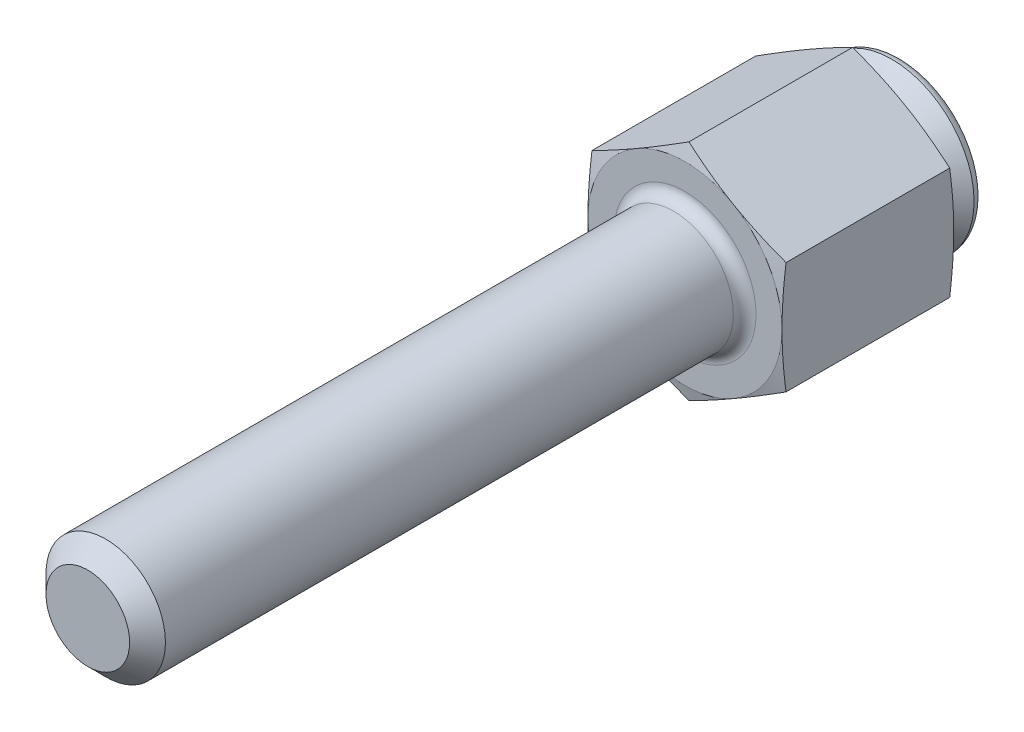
ISO-10303-21;
HEADER;
FILE_DESCRIPTION(('STEP AP214'),'2;1');
FILE_NAME('part.step','',(''),(''),'','','');
FILE_SCHEMA(('AUTOMOTIVE_DESIGN { 1 0 10303 214 1 1 1 1 }'));
ENDSEC;
DATA;
#1=APPLICATION_CONTEXT('core data for automotive mechanical design processes');
#2=APPLICATION_PROTOCOL_DEFINITION('international standard','automotive_design',2000,#1);
#3=PRODUCT_CONTEXT('',#1,'mechanical');
#4=PRODUCT('Part','Part','',(#3));
#5=PRODUCT_RELATED_PRODUCT_CATEGORY('part','',(#4));
#6=PRODUCT_DEFINITION_FORMATION('','',#4);
#7=PRODUCT_DEFINITION_CONTEXT('part definition',#1,'design');
#8=PRODUCT_DEFINITION('design','',#6,#7);
#9=PRODUCT_DEFINITION_SHAPE('','',#8);
#10=(LENGTH_UNIT() NAMED_UNIT(*) SI_UNIT(.MILLI.,.METRE.));
#11=(NAMED_UNIT(*) PLANE_ANGLE_UNIT() SI_UNIT($,.RADIAN.));
#12=(NAMED_UNIT(*) SI_UNIT($,.STERADIAN.) SOLID_ANGLE_UNIT());
#13=UNCERTAINTY_MEASURE_WITH_UNIT(LENGTH_MEASURE(1.E-05),#10,'distance_accuracy_value','');
#14=(GEOMETRIC_REPRESENTATION_CONTEXT(3) GLOBAL_UNCERTAINTY_ASSIGNED_CONTEXT((#13)) GLOBAL_UNIT_ASSIGNED_CONTEXT((#10,
#11,#12)) REPRESENTATION_CONTEXT('',''));
#15=CARTESIAN_POINT('',(0.,0.,0.));
#16=DIRECTION('',(0.,0.,1.));
#17=DIRECTION('',(1.,0.,0.));
#18=AXIS2_PLACEMENT_3D('',#15,#16,#17);
#19=CARTESIAN_POINT('',(0.,0.,6.5013999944));
#20=DIRECTION('',(0.,0.,-1.));
#21=DIRECTION('',(-0.250229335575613,0.968186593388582,0.));
#22=AXIS2_PLACEMENT_3D('',#19,#20,#21);
#23=SPHERICAL_SURFACE('',#22,5.);
#24=CARTESIAN_POINT('',(0.,0.,4.2191999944));
#25=DIRECTION('',(0.,0.,-1.));
#26=DIRECTION('',(-0.968186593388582,-0.250229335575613,0.));
#27=AXIS2_PLACEMENT_3D('',#24,#25,#26);
#28=CIRCLE('',#27,4.44877097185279);
#29=CARTESIAN_POINT('',(-1.1132130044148,4.30724041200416,4.2191999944));
#30=VERTEX_POINT('',#29);
#31=EDGE_CURVE('E9',#30,#30,#28,.F.);
#32=CARTESIAN_POINT('',(0.,0.,3.56696480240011));
#33=DIRECTION('',(0.,0.,1.));
#34=DIRECTION('',(-0.250229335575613,0.968186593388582,0.));
#35=AXIS2_PLACEMENT_3D('',#32,#33,#34);
#36=CIRCLE('',#35,4.04834411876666);
#37=CARTESIAN_POINT('',(-1.01301445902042,3.91955250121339,3.56696480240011));
#38=VERTEX_POINT('',#37);
#39=EDGE_CURVE('E282',#38,#38,#36,.T.);
#40=CARTESIAN_POINT('',(-1.1132130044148,4.30724041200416,4.2191999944));
#41=CARTESIAN_POINT('',(-1.11230155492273,4.30371383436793,4.21209962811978));
#42=CARTESIAN_POINT('',(-1.11138585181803,4.30017079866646,4.20500798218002));
#43=CARTESIAN_POINT('',(-1.10954595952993,4.29305189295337,4.19084229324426));
#44=CARTESIAN_POINT('',(-1.10862177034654,4.28947602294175,4.18376825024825));
#45=CARTESIAN_POINT('',(-1.10676492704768,4.2822915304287,4.16963792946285));
#46=CARTESIAN_POINT('',(-1.1058322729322,4.27868290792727,4.16258165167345));
#47=CARTESIAN_POINT('',(-1.10395852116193,4.27143299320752,4.14848702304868));
#48=CARTESIAN_POINT('',(-1.10301742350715,4.26779170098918,4.14144867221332));
#49=CARTESIAN_POINT('',(-1.10112680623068,4.26047653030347,4.12739005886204));
#50=CARTESIAN_POINT('',(-1.10017728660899,4.25680265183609,4.12036979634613));
#51=CARTESIAN_POINT('',(-1.09826984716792,4.24942239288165,4.10634752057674));
#52=CARTESIAN_POINT('',(-1.09731192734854,4.24571601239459,4.09934550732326));
#53=CARTESIAN_POINT('',(-1.09538770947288,4.23827083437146,4.08535989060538));
#54=CARTESIAN_POINT('',(-1.0944214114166,4.23453203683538,4.07837628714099));
#55=CARTESIAN_POINT('',(-1.09248045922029,4.22702211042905,4.06442765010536));
#56=CARTESIAN_POINT('',(-1.09150580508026,4.22325098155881,4.05746261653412));
#57=CARTESIAN_POINT('',(-1.08954816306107,4.21567647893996,4.04355127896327));
#58=CARTESIAN_POINT('',(-1.08856517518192,4.21187310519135,4.03660497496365));
#59=CARTESIAN_POINT('',(-1.08659088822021,4.2042342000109,4.0227312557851));
#60=CARTESIAN_POINT('',(-1.08559958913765,4.20039866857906,4.01580384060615));
#61=CARTESIAN_POINT('',(-1.08360870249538,4.19269553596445,4.00196805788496));
#62=CARTESIAN_POINT('',(-1.08260911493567,4.1888279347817,3.99505969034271));
#63=CARTESIAN_POINT('',(-1.08060167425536,4.18106075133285,3.98126216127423));
#64=CARTESIAN_POINT('',(-1.07959382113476,4.17716116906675,3.97437299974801));
#65=CARTESIAN_POINT('',(-1.07756987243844,4.16933011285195,3.96061404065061));
#66=CARTESIAN_POINT('',(-1.07655377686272,4.16539863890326,3.95374424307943));
#67=CARTESIAN_POINT('',(-1.07451336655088,4.15750388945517,3.94002416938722));
#68=CARTESIAN_POINT('',(-1.07348905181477,4.15354061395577,3.93317389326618));
#69=CARTESIAN_POINT('',(-1.0714322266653,4.14558235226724,3.91949301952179));
#70=CARTESIAN_POINT('',(-1.07039971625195,4.14158736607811,3.91266242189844));
#71=CARTESIAN_POINT('',(-1.06832652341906,4.13356577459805,3.89902106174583));
#72=CARTESIAN_POINT('',(-1.06728584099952,4.12953916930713,3.89221029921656));
#73=CARTESIAN_POINT('',(-1.06519632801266,4.12145443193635,3.8786087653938));
#74=CARTESIAN_POINT('',(-1.06414749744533,4.11739629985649,3.8718179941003));
#75=CARTESIAN_POINT('',(-1.06204171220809,4.10924860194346,3.8582565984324));
#76=CARTESIAN_POINT('',(-1.06098475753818,4.10515903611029,3.85148597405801));
#77=CARTESIAN_POINT('',(-1.05886274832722,4.09694856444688,3.83796502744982));
#78=CARTESIAN_POINT('',(-1.05779769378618,4.09282765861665,3.83121470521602));
#79=CARTESIAN_POINT('',(-1.0556595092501,4.08455460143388,3.81773451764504));
#80=CARTESIAN_POINT('',(-1.05458637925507,4.08040245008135,3.81100465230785));
#81=CARTESIAN_POINT('',(-1.0524320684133,4.07206699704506,3.79756553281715));
#82=CARTESIAN_POINT('',(-1.05135088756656,4.06788369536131,3.79085627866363));
#83=CARTESIAN_POINT('',(-1.04918049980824,4.0594860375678,3.77745853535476));
#84=CARTESIAN_POINT('',(-1.04809129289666,4.05527168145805,3.77077004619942));
#85=CARTESIAN_POINT('',(-1.0459048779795,4.04681201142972,3.75741398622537));
#86=CARTESIAN_POINT('',(-1.04480766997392,4.04256669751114,3.75074641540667));
#87=CARTESIAN_POINT('',(-1.04260527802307,4.03404520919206,3.7374323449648));
#88=CARTESIAN_POINT('',(-1.0415000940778,4.02976903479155,3.73078584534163));
#89=CARTESIAN_POINT('',(-1.03928177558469,4.021185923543,3.71751406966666));
#90=CARTESIAN_POINT('',(-1.03816864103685,4.01687898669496,3.71088879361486));
#91=CARTESIAN_POINT('',(-1.03593444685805,4.00823444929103,3.69765961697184));
#92=CARTESIAN_POINT('',(-1.03481338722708,4.00389684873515,3.69105571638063));
#93=CARTESIAN_POINT('',(-1.03256336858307,3.99519108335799,3.67786944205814));
#94=CARTESIAN_POINT('',(-1.03143440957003,3.99082291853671,3.67128706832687));
#95=CARTESIAN_POINT('',(-1.02916861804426,3.98205612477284,3.65814399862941));
#96=CARTESIAN_POINT('',(-1.02803178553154,3.97765749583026,3.65158330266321));
#97=CARTESIAN_POINT('',(-1.0257502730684,3.96882987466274,3.63848373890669));
#98=CARTESIAN_POINT('',(-1.02460559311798,3.96440088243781,3.63194487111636));
#99=CARTESIAN_POINT('',(-1.02230841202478,3.95551263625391,3.61888911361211));
#100=CARTESIAN_POINT('',(-1.02115591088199,3.95105338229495,3.61237222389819));
#101=CARTESIAN_POINT('',(-1.01884311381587,3.94210471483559,3.59936057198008));
#102=CARTESIAN_POINT('',(-1.01768281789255,3.93761530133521,3.5928658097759));
#103=CARTESIAN_POINT('',(-1.01535445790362,3.92860641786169,3.57989856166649));
#104=CARTESIAN_POINT('',(-1.01418639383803,3.92408694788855,3.57342607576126));
#105=CARTESIAN_POINT('',(-1.01301445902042,3.91955250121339,3.56696480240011));
#106=B_SPLINE_CURVE_WITH_KNOTS('',3,(#40,#41,#42,#43,#44,#45,#46,#47,#48,#49,#50,#51,#52,#53,
#54,#55,#56,#57,#58,#59,#60,#61,#62,#63,#64,#65,#66,#67,#68,#69,#70,#71,#72,#73,#74,#75,#76,#77,
#78,#79,#80,#81,#82,#83,#84,#85,#86,#87,#88,#89,#90,#91,#92,#93,#94,#95,#96,#97,#98,#99,#100,
#101,#102,#103,#104,#105),.UNSPECIFIED.,.F.,.F.,(4,2,2,2,2,2,2,2,2,2,2,2,2,2,2,2,2,2,2,2,2,2,2,
2,2,2,2,2,2,2,2,2,4),(0.,0.0239404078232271,0.0478808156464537,0.0718212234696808,
0.0957616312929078,0.119702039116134,0.143642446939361,0.167582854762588,0.191523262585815,
0.215463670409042,0.239404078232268,0.263344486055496,0.287284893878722,0.311225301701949,
0.335165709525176,0.359106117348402,0.383046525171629,0.406986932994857,0.430927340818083,
0.45486774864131,0.478808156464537,0.502748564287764,0.52668897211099,0.550629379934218,
0.574569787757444,0.598510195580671,0.622450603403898,0.646391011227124,0.670331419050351,
0.694271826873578,0.718212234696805,0.742152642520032,0.766093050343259),.UNSPECIFIED.);
#107=EDGE_CURVE('BSEAM14',#30,#38,#106,.T.);
#108=ORIENTED_EDGE('',*,*,#31,.F.);
#109=ORIENTED_EDGE('',*,*,#39,.T.);
#110=ORIENTED_EDGE('',*,*,#107,.T.);
#111=ORIENTED_EDGE('',*,*,#107,.F.);
#112=EDGE_LOOP('',(#108,#110,#109,#111));
#113=FACE_BOUND('',#112,.T.);
#114=ADVANCED_FACE('F14',(#113),#23,.T.);
#115=CARTESIAN_POINT('',(0.,0.,0.));
#116=DIRECTION('',(0.,0.,-1.));
#117=DIRECTION('',(0.250229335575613,-0.968186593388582,0.));
#118=AXIS2_PLACEMENT_3D('',#115,#116,#117);
#119=CYLINDRICAL_SURFACE('',#118,4.);
#120=CARTESIAN_POINT('',(0.,0.,3.41789549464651));
#121=DIRECTION('',(0.,0.,1.));
#122=DIRECTION('',(-0.250229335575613,0.968186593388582,0.));
#123=AXIS2_PLACEMENT_3D('',#120,#121,#122);
#124=CIRCLE('',#123,4.);
#125=CARTESIAN_POINT('',(-1.00091734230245,3.87274637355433,3.41789549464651));
#126=VERTEX_POINT('',#125);
#127=EDGE_CURVE('E280',#126,#126,#124,.F.);
#128=ORIENTED_EDGE('',*,*,#127,.T.);
#129=EDGE_LOOP('',(#128));
#130=FACE_BOUND('',#129,.T.);
#131=CARTESIAN_POINT('',(0.,0.,2.24021024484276));
#132=DIRECTION('',(0.,0.,-1.));
#133=DIRECTION('',(0.250229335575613,-0.968186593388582,0.));
#134=AXIS2_PLACEMENT_3D('',#131,#132,#133);
#135=CIRCLE('',#134,4.);
#136=CARTESIAN_POINT('',(1.00091734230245,-3.87274637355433,2.24021024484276));
#137=VERTEX_POINT('',#136);
#138=EDGE_CURVE('E277',#137,#137,#135,.F.);
#139=ORIENTED_EDGE('',*,*,#138,.T.);
#140=EDGE_LOOP('',(#139));
#141=FACE_BOUND('',#140,.T.);
#142=ADVANCED_FACE('F388',(#130,#141),#119,.T.);
#143=CARTESIAN_POINT('',(0.,0.,2.135));
#144=DIRECTION('',(0.,0.,-1.));
#145=DIRECTION('',(0.250229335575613,-0.968186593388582,0.));
#146=AXIS2_PLACEMENT_3D('',#143,#144,#145);
#147=CONICAL_SURFACE('',#146,4.,0.78539816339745);
#148=CARTESIAN_POINT('',(0.,0.,2.06060512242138));
#149=DIRECTION('',(0.,0.,-1.));
#150=DIRECTION('',(0.250229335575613,-0.968186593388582,0.));
#151=AXIS2_PLACEMENT_3D('',#148,#149,#150);
#152=CIRCLE('',#151,4.07439487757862);
#153=CARTESIAN_POINT('',(1.01953312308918,-3.94477449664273,2.06060512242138));
#154=VERTEX_POINT('',#153);
#155=EDGE_CURVE('E18',#154,#154,#152,.T.);
#156=ORIENTED_EDGE('',*,*,#155,.T.);
#157=EDGE_LOOP('',(#156));
#158=FACE_BOUND('',#157,.T.);
#159=CARTESIAN_POINT('',(0.,0.,0.635));
#160=DIRECTION('',(0.,0.,-1.));
#161=DIRECTION('',(0.250229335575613,-0.968186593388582,0.));
#162=AXIS2_PLACEMENT_3D('',#159,#160,#161);
#163=CIRCLE('',#162,5.5);
#164=CARTESIAN_POINT('',(1.37626134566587,-5.3250262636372,0.635));
#165=VERTEX_POINT('',#164);
#166=EDGE_CURVE('E271',#165,#165,#163,.T.);
#167=ORIENTED_EDGE('',*,*,#166,.F.);
#168=EDGE_LOOP('',(#167));
#169=FACE_BOUND('',#168,.T.);
#170=ADVANCED_FACE('F384',(#158,#169),#147,.T.);
#171=CARTESIAN_POINT('',(-1.37626134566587,5.3250262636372,0.));
#172=DIRECTION('',(0.,0.,1.));
#173=DIRECTION('',(-0.250229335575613,0.968186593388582,0.));
#174=AXIS2_PLACEMENT_3D('',#171,#172,#173);
#175=PLANE('',#174);
#176=CARTESIAN_POINT('',(0.,0.,0.));
#177=DIRECTION('',(0.,0.,1.));
#178=DIRECTION('',(-0.250229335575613,0.968186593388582,0.));
#179=AXIS2_PLACEMENT_3D('',#176,#177,#178);
#180=CIRCLE('',#179,4.865);
#181=CARTESIAN_POINT('',(-1.21736571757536,4.71022777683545,0.));
#182=VERTEX_POINT('',#181);
#183=EDGE_CURVE('E274',#182,#182,#180,.F.);
#184=ORIENTED_EDGE('',*,*,#183,.T.);
#185=EDGE_LOOP('',(#184));
#186=FACE_BOUND('',#185,.T.);
#187=ADVANCED_FACE('F380',(#186),#175,.F.);
#188=CARTESIAN_POINT('',(0.,0.,0.635));
#189=DIRECTION('',(0.,0.,1.));
#190=DIRECTION('',(-0.250229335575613,0.968186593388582,0.));
#191=AXIS2_PLACEMENT_3D('',#188,#189,#190);
#192=TOROIDAL_SURFACE('',#191,4.865,0.635);
#193=ORIENTED_EDGE('',*,*,#166,.T.);
#194=EDGE_LOOP('',(#193));
#195=FACE_BOUND('',#194,.T.);
#196=ORIENTED_EDGE('',*,*,#183,.F.);
#197=EDGE_LOOP('',(#196));
#198=FACE_BOUND('',#197,.T.);
#199=ADVANCED_FACE('F383',(#195,#198),#192,.T.);
#200=CARTESIAN_POINT('',(0.,0.,3.41789549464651));
#201=DIRECTION('',(0.,0.,1.));
#202=DIRECTION('',(-0.250229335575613,0.968186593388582,0.));
#203=AXIS2_PLACEMENT_3D('',#200,#201,#202);
#204=TOROIDAL_SURFACE('',#203,4.254,0.254);
#205=ORIENTED_EDGE('',*,*,#39,.F.);
#206=EDGE_LOOP('',(#205));
#207=FACE_BOUND('',#206,.T.);
#208=ORIENTED_EDGE('',*,*,#127,.F.);
#209=EDGE_LOOP('',(#208));
#210=FACE_BOUND('',#209,.T.);
#211=ADVANCED_FACE('F397',(#207,#210),#204,.F.);
#212=CARTESIAN_POINT('',(0.,0.,2.24021024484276));
#213=DIRECTION('',(0.,0.,-1.));
#214=DIRECTION('',(0.250229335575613,-0.968186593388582,0.));
#215=AXIS2_PLACEMENT_3D('',#212,#213,#214);
#216=TOROIDAL_SURFACE('',#215,4.254,0.254);
#217=ORIENTED_EDGE('',*,*,#138,.F.);
#218=EDGE_LOOP('',(#217));
#219=FACE_BOUND('',#218,.T.);
#220=ORIENTED_EDGE('',*,*,#155,.F.);
#221=EDGE_LOOP('',(#220));
#222=FACE_BOUND('',#221,.T.);
#223=ADVANCED_FACE('F16',(#219,#222),#216,.F.);
#224=CARTESIAN_POINT('',(0.,0.,54.4999999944));
#225=DIRECTION('',(0.,0.,1.));
#226=DIRECTION('',(1.,0.,0.));
#227=AXIS2_PLACEMENT_3D('',#224,#225,#226);
#228=PLANE('',#227);
#229=CARTESIAN_POINT('',(0.,0.,54.4999999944));
#230=DIRECTION('',(0.,0.,1.));
#231=DIRECTION('',(1.,0.,0.));
#232=AXIS2_PLACEMENT_3D('',#229,#230,#231);
#233=CIRCLE('',#232,2.8);
#234=CARTESIAN_POINT('',(2.8,0.,54.4999999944));
#235=VERTEX_POINT('',#234);
#236=EDGE_CURVE('E266',#235,#235,#233,.T.);
#237=ORIENTED_EDGE('',*,*,#236,.T.);
#238=EDGE_LOOP('',(#237));
#239=FACE_BOUND('',#238,.T.);
#240=ADVANCED_FACE('F378',(#239),#228,.T.);
#241=CARTESIAN_POINT('',(0.,0.,54.4999999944));
#242=DIRECTION('',(0.,0.,-1.));
#243=DIRECTION('',(-1.,0.,0.));
#244=AXIS2_PLACEMENT_3D('',#241,#242,#243);
#245=CONICAL_SURFACE('',#244,2.8,0.785398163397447);
#246=CARTESIAN_POINT('',(0.,0.,53.2999999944));
#247=DIRECTION('',(0.,0.,1.));
#248=DIRECTION('',(1.,0.,0.));
#249=AXIS2_PLACEMENT_3D('',#246,#247,#248);
#250=CIRCLE('',#249,4.);
#251=CARTESIAN_POINT('',(4.,0.,53.2999999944));
#252=VERTEX_POINT('',#251);
#253=EDGE_CURVE('E23',#252,#252,#250,.F.);
#254=ORIENTED_EDGE('',*,*,#253,.F.);
#255=EDGE_LOOP('',(#254));
#256=FACE_BOUND('',#255,.T.);
#257=ORIENTED_EDGE('',*,*,#236,.F.);
#258=EDGE_LOOP('',(#257));
#259=FACE_BOUND('',#258,.T.);
#260=ADVANCED_FACE('F375',(#256,#259),#245,.T.);
#261=CARTESIAN_POINT('',(0.,0.,54.4999999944));
#262=DIRECTION('',(0.,0.,-1.));
#263=DIRECTION('',(-1.,0.,0.));
#264=AXIS2_PLACEMENT_3D('',#261,#262,#263);
#265=CYLINDRICAL_SURFACE('',#264,4.);
#266=ORIENTED_EDGE('',*,*,#253,.T.);
#267=EDGE_LOOP('',(#266));
#268=FACE_BOUND('',#267,.T.);
#269=CARTESIAN_POINT('',(0.,0.,15.2619999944));
#270=DIRECTION('',(0.,0.,1.));
#271=DIRECTION('',(1.,0.,0.));
#272=AXIS2_PLACEMENT_3D('',#269,#270,#271);
#273=CIRCLE('',#272,4.);
#274=CARTESIAN_POINT('',(4.,0.,15.2619999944));
#275=VERTEX_POINT('',#274);
#276=EDGE_CURVE('E260',#275,#275,#273,.T.);
#277=ORIENTED_EDGE('',*,*,#276,.T.);
#278=EDGE_LOOP('',(#277));
#279=FACE_BOUND('',#278,.T.);
#280=ADVANCED_FACE('F373',(#268,#279),#265,.T.);
#281=CARTESIAN_POINT('',(0.,0.,15.2619999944));
#282=DIRECTION('',(0.,0.,1.));
#283=DIRECTION('',(1.,0.,0.));
#284=AXIS2_PLACEMENT_3D('',#281,#282,#283);
#285=TOROIDAL_SURFACE('',#284,4.762,0.762);
#286=CARTESIAN_POINT('',(0.,0.,14.4999999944));
#287=DIRECTION('',(0.,0.,1.));
#288=DIRECTION('',(1.,0.,0.));
#289=AXIS2_PLACEMENT_3D('',#286,#287,#288);
#290=CIRCLE('',#289,4.762);
#291=CARTESIAN_POINT('',(4.762,0.,14.4999999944));
#292=VERTEX_POINT('',#291);
#293=EDGE_CURVE('E263',#292,#292,#290,.F.);
#294=ORIENTED_EDGE('',*,*,#293,.F.);
#295=EDGE_LOOP('',(#294));
#296=FACE_BOUND('',#295,.T.);
#297=ORIENTED_EDGE('',*,*,#276,.F.);
#298=EDGE_LOOP('',(#297));
#299=FACE_BOUND('',#298,.T.);
#300=ADVANCED_FACE('F370',(#296,#299),#285,.F.);
#301=CARTESIAN_POINT('',(-6.5,-3.75277674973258,14.4999999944));
#302=DIRECTION('',(0.,0.,1.));
#303=DIRECTION('',(1.,0.,0.));
#304=AXIS2_PLACEMENT_3D('',#301,#302,#303);
#305=PLANE('',#304);
#306=CARTESIAN_POINT('',(0.,0.,14.4999999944));
#307=DIRECTION('',(0.,0.,1.));
#308=DIRECTION('',(1.,0.,0.));
#309=AXIS2_PLACEMENT_3D('',#306,#307,#308);
#310=CIRCLE('',#309,6.5);
#311=CARTESIAN_POINT('',(3.25,-5.62916512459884,14.4999999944));
#312=VERTEX_POINT('',#311);
#313=CARTESIAN_POINT('',(6.5,0.,14.4999999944));
#314=VERTEX_POINT('',#313);
#315=EDGE_CURVE('E239',#312,#314,#310,.T.);
#316=ORIENTED_EDGE('',*,*,#315,.T.);
#317=CARTESIAN_POINT('',(3.25,5.62916512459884,14.4999999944));
#318=VERTEX_POINT('',#317);
#319=EDGE_CURVE('E130',#314,#318,#310,.T.);
#320=ORIENTED_EDGE('',*,*,#319,.T.);
#321=CARTESIAN_POINT('',(-3.25,5.62916512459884,14.4999999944));
#322=VERTEX_POINT('',#321);
#323=EDGE_CURVE('E331',#318,#322,#310,.T.);
#324=ORIENTED_EDGE('',*,*,#323,.T.);
#325=CARTESIAN_POINT('',(0.,0.,14.4999999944));
#326=DIRECTION('',(0.,0.,-1.));
#327=DIRECTION('',(-1.,0.,0.));
#328=AXIS2_PLACEMENT_3D('',#325,#326,#327);
#329=CIRCLE('',#328,6.5);
#330=CARTESIAN_POINT('',(-6.5,0.,14.4999999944));
#331=VERTEX_POINT('',#330);
#332=EDGE_CURVE('E668',#331,#322,#329,.T.);
#333=ORIENTED_EDGE('',*,*,#332,.F.);
#334=CARTESIAN_POINT('',(-3.25,-5.62916512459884,14.4999999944));
#335=VERTEX_POINT('',#334);
#336=EDGE_CURVE('E330',#331,#335,#310,.T.);
#337=ORIENTED_EDGE('',*,*,#336,.T.);
#338=EDGE_CURVE('E253',#335,#312,#310,.T.);
#339=ORIENTED_EDGE('',*,*,#338,.T.);
#340=EDGE_LOOP('',(#316,#320,#324,#333,#337,#339));
#341=FACE_BOUND('',#340,.T.);
#342=ORIENTED_EDGE('',*,*,#293,.T.);
#343=EDGE_LOOP('',(#342));
#344=FACE_BOUND('',#343,.T.);
#345=ADVANCED_FACE('F326',(#341,#344),#305,.T.);
#346=CARTESIAN_POINT('',(0.,0.,13.0858363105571));
#347=DIRECTION('',(0.,0.,-1.));
#348=DIRECTION('',(-1.,0.,0.));
#349=AXIS2_PLACEMENT_3D('',#346,#347,#348);
#350=CONICAL_SURFACE('',#349,11.7777307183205,1.30899693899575);
#351=ORIENTED_EDGE('',*,*,#332,.T.);
#352=CARTESIAN_POINT('',(-6.5002,3.75266127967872,14.2305318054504));
#353=CARTESIAN_POINT('',(-6.23025475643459,3.90851423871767,14.272310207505));
#354=CARTESIAN_POINT('',(-5.95982006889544,4.06464977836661,14.3102381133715));
#355=CARTESIAN_POINT('',(-5.41799562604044,4.37747226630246,14.3768739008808));
#356=CARTESIAN_POINT('',(-5.14660552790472,4.53415941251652,14.4055780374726));
#357=CARTESIAN_POINT('',(-4.60451571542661,4.84713511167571,14.4520905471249));
#358=CARTESIAN_POINT('',(-4.33381966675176,5.00342154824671,14.4699543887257));
#359=CARTESIAN_POINT('',(-3.79208236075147,5.31619372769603,14.4939079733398));
#360=CARTESIAN_POINT('',(-3.52104118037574,5.47267942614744,14.4999999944));
#361=CARTESIAN_POINT('',(-2.97895881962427,5.78565082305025,14.4999999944));
#362=CARTESIAN_POINT('',(-2.70791763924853,5.94213652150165,14.4939079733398));
#363=CARTESIAN_POINT('',(-2.16618033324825,6.25490870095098,14.4699543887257));
#364=CARTESIAN_POINT('',(-1.8954842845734,6.41119513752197,14.4520905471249));
#365=CARTESIAN_POINT('',(-1.35339447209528,6.72417083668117,14.4055780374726));
#366=CARTESIAN_POINT('',(-1.08200437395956,6.88085798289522,14.3768739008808));
#367=CARTESIAN_POINT('',(-0.540179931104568,7.19368047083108,14.3102381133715));
#368=CARTESIAN_POINT('',(-0.269745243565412,7.34981601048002,14.272310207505));
#369=CARTESIAN_POINT('',(0.000199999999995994,7.50566896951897,14.2305318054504));
#370=B_SPLINE_CURVE_WITH_KNOTS('',3,(#352,#353,#354,#355,#356,#357,#358,#359,#360,#361,#362,
#363,#364,#365,#366,#367,#368,#369),.UNSPECIFIED.,.F.,.F.,(4,2,2,2,2,2,2,2,4),(0.,
0.943529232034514,1.88744107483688,2.82648138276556,3.76533995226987,4.70419852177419,
5.64323882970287,6.58715067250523,7.53067990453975),.UNSPECIFIED.);
#371=CARTESIAN_POINT('',(-6.5,3.75277674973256,14.230562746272));
#372=VERTEX_POINT('',#371);
#373=EDGE_CURVE('E338',#372,#322,#370,.T.);
#374=ORIENTED_EDGE('',*,*,#373,.F.);
#375=CARTESIAN_POINT('',(-6.5,-10.0044654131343,13.0448738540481));
#376=CARTESIAN_POINT('',(-6.5,-9.7086784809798,13.1113166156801));
#377=CARTESIAN_POINT('',(-6.5,-9.41270865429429,13.1769595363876));
#378=CARTESIAN_POINT('',(-6.5,-8.82031321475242,13.3062138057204));
#379=CARTESIAN_POINT('',(-6.5,-8.52388758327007,13.36982506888));
#380=CARTESIAN_POINT('',(-6.5,-7.93023646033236,13.494637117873));
#381=CARTESIAN_POINT('',(-6.5,-7.63301047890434,13.5558355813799));
#382=CARTESIAN_POINT('',(-6.5,-7.03794541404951,13.6751737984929));
#383=CARTESIAN_POINT('',(-6.5,-6.74010633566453,13.7333135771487));
#384=CARTESIAN_POINT('',(-6.5,-6.14610081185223,13.8453527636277));
#385=CARTESIAN_POINT('',(-6.5,-5.84994010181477,13.8992824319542));
#386=CARTESIAN_POINT('',(-6.5,-5.25681519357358,14.0025175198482));
#387=CARTESIAN_POINT('',(-6.5,-4.95985101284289,14.0518230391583));
#388=CARTESIAN_POINT('',(-6.5,-4.36505179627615,14.1447161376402));
#389=CARTESIAN_POINT('',(-6.5,-4.06721684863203,14.1883042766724));
#390=CARTESIAN_POINT('',(-6.5,-3.47059684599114,14.2684922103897));
#391=CARTESIAN_POINT('',(-6.5,-3.17181178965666,14.305091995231));
#392=CARTESIAN_POINT('',(-6.5,-2.56988519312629,14.3702843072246));
#393=CARTESIAN_POINT('',(-6.5,-2.26673301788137,14.3987800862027));
#394=CARTESIAN_POINT('',(-6.5,-1.65965008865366,14.4458085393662));
#395=CARTESIAN_POINT('',(-6.5,-1.35571935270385,14.4643414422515));
#396=CARTESIAN_POINT('',(-6.5,-0.747523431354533,14.4903642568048));
#397=CARTESIAN_POINT('',(-6.5,-0.443258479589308,14.4978595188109));
#398=CARTESIAN_POINT('',(-6.5,0.165338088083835,14.501344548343));
#399=CARTESIAN_POINT('',(-6.5,0.469669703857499,14.4973343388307));
#400=CARTESIAN_POINT('',(-6.5,1.07910960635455,14.4780322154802));
#401=CARTESIAN_POINT('',(-6.5,1.38421652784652,14.4626980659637));
#402=CARTESIAN_POINT('',(-6.5,1.99372315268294,14.4216291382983));
#403=CARTESIAN_POINT('',(-6.5,2.29812283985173,14.3958941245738));
#404=CARTESIAN_POINT('',(-6.50000000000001,2.90621194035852,14.3353423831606));
#405=CARTESIAN_POINT('',(-6.50000000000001,3.20990073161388,14.3005195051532));
#406=CARTESIAN_POINT('',(-6.5,3.8162976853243,14.2232646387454));
#407=CARTESIAN_POINT('',(-6.5,4.11900584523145,14.180832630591));
#408=CARTESIAN_POINT('',(-6.5,4.7153060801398,14.0909709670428));
#409=CARTESIAN_POINT('',(-6.5,5.0089234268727,14.0437073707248));
#410=CARTESIAN_POINT('',(-6.50000000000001,5.59535016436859,13.9443851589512));
#411=CARTESIAN_POINT('',(-6.50000000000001,5.88815952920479,13.8923263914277));
#412=CARTESIAN_POINT('',(-6.50000000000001,6.47308937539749,13.7843266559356));
#413=CARTESIAN_POINT('',(-6.50000000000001,6.76520978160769,13.7283852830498));
#414=CARTESIAN_POINT('',(-6.50000000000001,7.34883235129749,13.6133576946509));
#415=CARTESIAN_POINT('',(-6.50000000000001,7.64033450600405,13.5542714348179));
#416=CARTESIAN_POINT('',(-6.50000000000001,8.51421406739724,13.3731782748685));
#417=CARTESIAN_POINT('',(-6.50000000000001,9.09580222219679,13.2473677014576));
#418=CARTESIAN_POINT('',(-6.50000000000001,10.2574156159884,12.9889787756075));
#419=CARTESIAN_POINT('',(-6.50000000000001,10.8374409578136,12.856400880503));
#420=CARTESIAN_POINT('',(-6.50000000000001,11.9903925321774,12.587928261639));
#421=CARTESIAN_POINT('',(-6.50000000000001,12.5633300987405,12.4520820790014));
#422=CARTESIAN_POINT('',(-6.50000000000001,13.7084200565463,12.1770780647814));
#423=CARTESIAN_POINT('',(-6.50000000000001,14.2805724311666,12.0379201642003));
#424=CARTESIAN_POINT('',(-6.50000000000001,15.4235044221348,11.757366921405));
#425=CARTESIAN_POINT('',(-6.50000000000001,15.9942848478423,11.6159748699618));
#426=CARTESIAN_POINT('',(-6.50000000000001,17.1353614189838,11.3313338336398));
#427=CARTESIAN_POINT('',(-6.50000000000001,17.7056575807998,11.1880849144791));
#428=CARTESIAN_POINT('',(-6.5,18.2757873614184,11.0441847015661));
#429=B_SPLINE_CURVE_WITH_KNOTS('',3,(#375,#376,#377,#378,#379,#380,#381,#382,#383,#384,#385,
#386,#387,#388,#389,#390,#391,#392,#393,#394,#395,#396,#397,#398,#399,#400,#401,#402,#403,#404,
#405,#406,#407,#408,#409,#410,#411,#412,#413,#414,#415,#416,#417,#418,#419,#420,#421,#422,#423,
#424,#425,#426,#427,#428),.UNSPECIFIED.,.F.,.F.,(4,2,2,2,2,2,2,2,2,2,2,2,2,2,2,2,2,2,2,2,2,2,2,
2,2,2,4),(0.,0.909476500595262,1.8189912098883,2.72936096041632,3.63972325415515,
4.54278656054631,5.44583038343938,6.34878571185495,7.2517423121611,8.16506499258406,
9.07836670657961,9.9912255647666,10.9040826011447,11.8203616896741,12.736661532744,
13.6535831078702,14.5705070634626,15.4626502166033,16.3548216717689,17.24708631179,
18.1393635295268,19.9244135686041,21.7093431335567,23.4757957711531,25.2422852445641,
27.0063787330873,28.7704099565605),.UNSPECIFIED.);
#430=EDGE_CURVE('E337',#331,#372,#429,.T.);
#431=ORIENTED_EDGE('',*,*,#430,.F.);
#432=EDGE_LOOP('',(#351,#374,#431));
#433=FACE_BOUND('',#432,.T.);
#434=ADVANCED_FACE('F439',(#433),#350,.T.);
#435=ORIENTED_EDGE('',*,*,#336,.F.);
#436=CARTESIAN_POINT('',(-6.5,-3.75277674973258,14.230562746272));
#437=VERTEX_POINT('',#436);
#438=EDGE_CURVE('E308',#437,#331,#429,.T.);
#439=ORIENTED_EDGE('',*,*,#438,.F.);
#440=CARTESIAN_POINT('',(0.000199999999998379,-7.50566896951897,14.2305318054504));
#441=CARTESIAN_POINT('',(-0.26974524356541,-7.34981601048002,14.272310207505));
#442=CARTESIAN_POINT('',(-0.540179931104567,-7.19368047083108,14.3102381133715));
#443=CARTESIAN_POINT('',(-1.08200437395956,-6.88085798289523,14.3768739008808));
#444=CARTESIAN_POINT('',(-1.35339447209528,-6.72417083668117,14.4055780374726));
#445=CARTESIAN_POINT('',(-1.89548428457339,-6.41119513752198,14.4520905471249));
#446=CARTESIAN_POINT('',(-2.16618033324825,-6.25490870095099,14.4699543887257));
#447=CARTESIAN_POINT('',(-2.70791763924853,-5.94213652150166,14.4939079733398));
#448=CARTESIAN_POINT('',(-2.97895881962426,-5.78565082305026,14.4999999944));
#449=CARTESIAN_POINT('',(-3.52104118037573,-5.47267942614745,14.4999999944));
#450=CARTESIAN_POINT('',(-3.79208236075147,-5.31619372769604,14.4939079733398));
#451=CARTESIAN_POINT('',(-4.33381966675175,-5.00342154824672,14.4699543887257));
#452=CARTESIAN_POINT('',(-4.60451571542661,-4.84713511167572,14.4520905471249));
#453=CARTESIAN_POINT('',(-5.14660552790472,-4.53415941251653,14.4055780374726));
#454=CARTESIAN_POINT('',(-5.41799562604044,-4.37747226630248,14.3768739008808));
#455=CARTESIAN_POINT('',(-5.95982006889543,-4.06464977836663,14.3102381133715));
#456=CARTESIAN_POINT('',(-6.23025475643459,-3.90851423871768,14.272310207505));
#457=CARTESIAN_POINT('',(-6.5002,-3.75266127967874,14.2305318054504));
#458=B_SPLINE_CURVE_WITH_KNOTS('',3,(#440,#441,#442,#443,#444,#445,#446,#447,#448,#449,#450,
#451,#452,#453,#454,#455,#456,#457),.UNSPECIFIED.,.F.,.F.,(4,2,2,2,2,2,2,2,4),(0.,
0.943529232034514,1.88744107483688,2.82648138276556,3.76533995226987,4.70419852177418,
5.64323882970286,6.58715067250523,7.53067990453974),.UNSPECIFIED.);
#459=EDGE_CURVE('E212',#335,#437,#458,.T.);
#460=ORIENTED_EDGE('',*,*,#459,.F.);
#461=EDGE_LOOP('',(#435,#439,#460));
#462=FACE_BOUND('',#461,.T.);
#463=ADVANCED_FACE('F446',(#462),#350,.T.);
#464=ORIENTED_EDGE('',*,*,#338,.F.);
#465=CARTESIAN_POINT('',(0.,-7.50555349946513,14.230562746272));
#466=VERTEX_POINT('',#465);
#467=EDGE_CURVE('E220',#466,#335,#458,.T.);
#468=ORIENTED_EDGE('',*,*,#467,.F.);
#469=CARTESIAN_POINT('',(6.5002,-3.75266127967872,14.2305318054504));
#470=CARTESIAN_POINT('',(6.23025475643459,-3.90851423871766,14.272310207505));
#471=CARTESIAN_POINT('',(5.95982006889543,-4.06464977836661,14.3102381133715));
#472=CARTESIAN_POINT('',(5.41799562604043,-4.37747226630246,14.3768739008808));
#473=CARTESIAN_POINT('',(5.14660552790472,-4.53415941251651,14.4055780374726));
#474=CARTESIAN_POINT('',(4.6045157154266,-4.84713511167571,14.4520905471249));
#475=CARTESIAN_POINT('',(4.33381966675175,-5.0034215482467,14.4699543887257));
#476=CARTESIAN_POINT('',(3.79208236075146,-5.31619372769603,14.4939079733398));
#477=CARTESIAN_POINT('',(3.52104118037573,-5.47267942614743,14.4999999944));
#478=CARTESIAN_POINT('',(2.97895881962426,-5.78565082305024,14.4999999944));
#479=CARTESIAN_POINT('',(2.70791763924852,-5.94213652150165,14.4939079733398));
#480=CARTESIAN_POINT('',(2.16618033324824,-6.25490870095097,14.4699543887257));
#481=CARTESIAN_POINT('',(1.89548428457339,-6.41119513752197,14.4520905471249));
#482=CARTESIAN_POINT('',(1.35339447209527,-6.72417083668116,14.4055780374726));
#483=CARTESIAN_POINT('',(1.08200437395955,-6.88085798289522,14.3768739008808));
#484=CARTESIAN_POINT('',(0.540179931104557,-7.19368047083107,14.3102381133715));
#485=CARTESIAN_POINT('',(0.269745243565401,-7.34981601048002,14.272310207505));
#486=CARTESIAN_POINT('',(-0.000200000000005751,-7.50566896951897,14.2305318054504));
#487=B_SPLINE_CURVE_WITH_KNOTS('',3,(#469,#470,#471,#472,#473,#474,#475,#476,#477,#478,#479,
#480,#481,#482,#483,#484,#485,#486),.UNSPECIFIED.,.F.,.F.,(4,2,2,2,2,2,2,2,4),(0.,
0.943529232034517,1.88744107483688,2.82648138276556,3.76533995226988,4.70419852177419,
5.64323882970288,6.58715067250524,7.53067990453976),.UNSPECIFIED.);
#488=EDGE_CURVE('E227',#312,#466,#487,.T.);
#489=ORIENTED_EDGE('',*,*,#488,.F.);
#490=EDGE_LOOP('',(#464,#468,#489));
#491=FACE_BOUND('',#490,.T.);
#492=ADVANCED_FACE('F316',(#491),#350,.T.);
#493=CARTESIAN_POINT('',(6.5,-10.0044654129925,13.0448738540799));
#494=CARTESIAN_POINT('',(6.50000000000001,-9.70867848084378,13.1113166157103));
#495=CARTESIAN_POINT('',(6.50000000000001,-9.412708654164,13.1769595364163));
#496=CARTESIAN_POINT('',(6.50000000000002,-8.82031321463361,13.3062138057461));
#497=CARTESIAN_POINT('',(6.50000000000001,-8.52388758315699,13.3698250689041));
#498=CARTESIAN_POINT('',(6.50000000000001,-7.9302364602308,13.4946371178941));
#499=CARTESIAN_POINT('',(6.50000000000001,-7.63301047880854,13.5558355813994));
#500=CARTESIAN_POINT('',(6.50000000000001,-7.03794541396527,13.6751737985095));
#501=CARTESIAN_POINT('',(6.50000000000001,-6.74010633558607,13.7333135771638));
#502=CARTESIAN_POINT('',(6.50000000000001,-6.1461008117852,13.84535276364));
#503=CARTESIAN_POINT('',(6.50000000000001,-5.8499401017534,13.8992824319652));
#504=CARTESIAN_POINT('',(6.50000000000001,-5.25681519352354,14.0025175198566));
#505=CARTESIAN_POINT('',(6.50000000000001,-4.95985101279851,14.0518230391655));
#506=CARTESIAN_POINT('',(6.50000000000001,-4.36505179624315,14.1447161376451));
#507=CARTESIAN_POINT('',(6.50000000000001,-4.06721684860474,14.1883042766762));
#508=CARTESIAN_POINT('',(6.50000000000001,-3.47059684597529,14.2684922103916));
#509=CARTESIAN_POINT('',(6.5,-3.17181178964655,14.3050919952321));
#510=CARTESIAN_POINT('',(6.5,-2.56988519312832,14.3702843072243));
#511=CARTESIAN_POINT('',(6.5,-2.26673301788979,14.3987800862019));
#512=CARTESIAN_POINT('',(6.50000000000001,-1.65965008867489,14.4458085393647));
#513=CARTESIAN_POINT('',(6.50000000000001,-1.3557193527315,14.46434144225));
#514=CARTESIAN_POINT('',(6.5,-0.74752343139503,14.4903642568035));
#515=CARTESIAN_POINT('',(6.5,-0.443258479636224,14.4978595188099));
#516=CARTESIAN_POINT('',(6.5,0.165338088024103,14.5013445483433));
#517=CARTESIAN_POINT('',(6.5,0.46966970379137,14.4973343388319));
#518=CARTESIAN_POINT('',(6.5,1.07910960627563,14.4780322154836));
#519=CARTESIAN_POINT('',(6.5,1.3842165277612,14.4626980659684));
#520=CARTESIAN_POINT('',(6.5,1.99372315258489,14.421629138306));
#521=CARTESIAN_POINT('',(6.5,2.29812283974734,14.3958941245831));
#522=CARTESIAN_POINT('',(6.5,2.90621194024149,14.3353423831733));
#523=CARTESIAN_POINT('',(6.5,3.20990073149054,14.3005195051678));
#524=CARTESIAN_POINT('',(6.5,3.8162976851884,14.2232646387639));
#525=CARTESIAN_POINT('',(6.5,4.1190058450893,14.1808326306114));
#526=CARTESIAN_POINT('',(6.5,4.71530607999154,14.0909709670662));
#527=CARTESIAN_POINT('',(6.5,5.00892342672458,14.0437073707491));
#528=CARTESIAN_POINT('',(6.5,5.59535016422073,13.9443851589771));
#529=CARTESIAN_POINT('',(6.5,5.88815952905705,13.8923263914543));
#530=CARTESIAN_POINT('',(6.5,6.47308937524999,13.7843266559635));
#531=CARTESIAN_POINT('',(6.5,6.7652097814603,13.7283852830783));
#532=CARTESIAN_POINT('',(6.5,7.3488323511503,13.6133576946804));
#533=CARTESIAN_POINT('',(6.5,7.64033450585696,13.5542714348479));
#534=CARTESIAN_POINT('',(6.49999999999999,8.51421406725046,13.3731782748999));
#535=CARTESIAN_POINT('',(6.49999999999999,9.09580222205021,13.2473677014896));
#536=CARTESIAN_POINT('',(6.49999999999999,10.2574156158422,12.9889787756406));
#537=CARTESIAN_POINT('',(6.49999999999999,10.8374409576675,12.8564008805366));
#538=CARTESIAN_POINT('',(6.49999999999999,11.9903925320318,12.5879282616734));
#539=CARTESIAN_POINT('',(6.49999999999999,12.5633300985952,12.452082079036));
#540=CARTESIAN_POINT('',(6.49999999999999,13.7084200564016,12.1770780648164));
#541=CARTESIAN_POINT('',(6.49999999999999,14.2805724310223,12.0379201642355));
#542=CARTESIAN_POINT('',(6.49999999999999,15.4235044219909,11.7573669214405));
#543=CARTESIAN_POINT('',(6.49999999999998,15.9942848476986,11.6159748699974));
#544=CARTESIAN_POINT('',(6.49999999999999,17.1353614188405,11.3313338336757));
#545=CARTESIAN_POINT('',(6.49999999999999,17.7056575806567,11.1880849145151));
#546=CARTESIAN_POINT('',(6.5,18.2757873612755,11.0441847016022));
#547=B_SPLINE_CURVE_WITH_KNOTS('',3,(#493,#494,#495,#496,#497,#498,#499,#500,#501,#502,#503,
#504,#505,#506,#507,#508,#509,#510,#511,#512,#513,#514,#515,#516,#517,#518,#519,#520,#521,#522,
#523,#524,#525,#526,#527,#528,#529,#530,#531,#532,#533,#534,#535,#536,#537,#538,#539,#540,#541,
#542,#543,#544,#545,#546),.UNSPECIFIED.,.F.,.F.,(4,2,2,2,2,2,2,2,2,2,2,2,2,2,2,2,2,2,2,2,2,2,2,
2,2,2,4),(0.,0.909476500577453,1.81899120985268,2.72936096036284,3.63972325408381,
4.54278656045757,5.44583038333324,6.34878571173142,7.25174231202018,8.1650649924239,
9.07836670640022,9.991225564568,10.9040826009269,11.8203616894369,12.7366615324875,
13.6535831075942,14.5705070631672,15.4626502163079,16.3548216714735,17.2470863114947,
18.1393635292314,19.9244135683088,21.7093431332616,23.4757957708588,25.2422852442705,
27.0063787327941,28.7704099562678),.UNSPECIFIED.);
#548=CARTESIAN_POINT('',(6.5,-3.75277674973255,14.230562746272));
#549=VERTEX_POINT('',#548);
#550=EDGE_CURVE('E235',#314,#549,#547,.F.);
#551=ORIENTED_EDGE('',*,*,#550,.F.);
#552=ORIENTED_EDGE('',*,*,#315,.F.);
#553=EDGE_CURVE('E234',#549,#312,#487,.T.);
#554=ORIENTED_EDGE('',*,*,#553,.F.);
#555=EDGE_LOOP('',(#551,#552,#554));
#556=FACE_BOUND('',#555,.T.);
#557=ADVANCED_FACE('F323',(#556),#350,.T.);
#558=CARTESIAN_POINT('',(-0.000200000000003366,7.50566896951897,14.2305318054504));
#559=CARTESIAN_POINT('',(0.269745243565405,7.34981601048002,14.272310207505));
#560=CARTESIAN_POINT('',(0.540179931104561,7.19368047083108,14.3102381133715));
#561=CARTESIAN_POINT('',(1.08200437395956,6.88085798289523,14.3768739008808));
#562=CARTESIAN_POINT('',(1.35339447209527,6.72417083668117,14.4055780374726));
#563=CARTESIAN_POINT('',(1.89548428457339,6.41119513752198,14.4520905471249));
#564=CARTESIAN_POINT('',(2.16618033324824,6.25490870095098,14.4699543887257));
#565=CARTESIAN_POINT('',(2.70791763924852,5.94213652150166,14.4939079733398));
#566=CARTESIAN_POINT('',(2.97895881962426,5.78565082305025,14.4999999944));
#567=CARTESIAN_POINT('',(3.52104118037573,5.47267942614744,14.4999999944));
#568=CARTESIAN_POINT('',(3.79208236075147,5.31619372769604,14.4939079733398));
#569=CARTESIAN_POINT('',(4.33381966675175,5.00342154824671,14.4699543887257));
#570=CARTESIAN_POINT('',(4.6045157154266,4.84713511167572,14.4520905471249));
#571=CARTESIAN_POINT('',(5.14660552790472,4.53415941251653,14.4055780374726));
#572=CARTESIAN_POINT('',(5.41799562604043,4.37747226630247,14.3768739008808));
#573=CARTESIAN_POINT('',(5.95982006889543,4.06464977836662,14.3102381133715));
#574=CARTESIAN_POINT('',(6.23025475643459,3.90851423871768,14.272310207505));
#575=CARTESIAN_POINT('',(6.5002,3.75266127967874,14.2305318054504));
#576=B_SPLINE_CURVE_WITH_KNOTS('',3,(#558,#559,#560,#561,#562,#563,#564,#565,#566,#567,#568,
#569,#570,#571,#572,#573,#574,#575),.UNSPECIFIED.,.F.,.F.,(4,2,2,2,2,2,2,2,4),(0.,
0.943529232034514,1.88744107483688,2.82648138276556,3.76533995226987,4.70419852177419,
5.64323882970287,6.58715067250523,7.53067990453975),.UNSPECIFIED.);
#577=CARTESIAN_POINT('',(6.5,3.75277674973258,14.230562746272));
#578=VERTEX_POINT('',#577);
#579=EDGE_CURVE('E304',#318,#578,#576,.T.);
#580=ORIENTED_EDGE('',*,*,#579,.F.);
#581=ORIENTED_EDGE('',*,*,#319,.F.);
#582=EDGE_CURVE('E221',#578,#314,#547,.F.);
#583=ORIENTED_EDGE('',*,*,#582,.F.);
#584=EDGE_LOOP('',(#580,#581,#583));
#585=FACE_BOUND('',#584,.T.);
#586=ADVANCED_FACE('F448',(#585),#350,.T.);
#587=CARTESIAN_POINT('',(0.,7.50555349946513,14.230562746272));
#588=VERTEX_POINT('',#587);
#589=EDGE_CURVE('E340',#322,#588,#370,.T.);
#590=ORIENTED_EDGE('',*,*,#589,.F.);
#591=ORIENTED_EDGE('',*,*,#323,.F.);
#592=EDGE_CURVE('E310',#588,#318,#576,.T.);
#593=ORIENTED_EDGE('',*,*,#592,.F.);
#594=EDGE_LOOP('',(#590,#591,#593));
#595=FACE_BOUND('',#594,.T.);
#596=ADVANCED_FACE('F172',(#595),#350,.T.);
#597=CARTESIAN_POINT('',(-6.5,3.75277674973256,14.4999999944));
#598=DIRECTION('',(-0.5,0.866025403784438,0.));
#599=DIRECTION('',(0.866025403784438,0.5,0.));
#600=AXIS2_PLACEMENT_3D('',#597,#598,#599);
#601=PLANE('',#600);
#602=DIRECTION('',(0.,0.,-1.));
#603=VECTOR('',#602,1.);
#604=CARTESIAN_POINT('',(0.,7.50555349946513,14.4999999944));
#605=LINE('',#604,#603);
#606=CARTESIAN_POINT('',(0.,7.50555349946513,3.26943724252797));
#607=VERTEX_POINT('',#606);
#608=EDGE_CURVE('E246',#588,#607,#605,.T.);
#609=ORIENTED_EDGE('',*,*,#608,.T.);
#610=CARTESIAN_POINT('',(0.000199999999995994,7.50566896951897,3.26946818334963));
#611=CARTESIAN_POINT('',(-0.269745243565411,7.34981601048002,3.22768978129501));
#612=CARTESIAN_POINT('',(-0.540179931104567,7.19368047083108,3.18976187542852));
#613=CARTESIAN_POINT('',(-1.08200437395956,6.88085798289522,3.12312608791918));
#614=CARTESIAN_POINT('',(-1.35339447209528,6.72417083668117,3.09442195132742));
#615=CARTESIAN_POINT('',(-1.89548428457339,6.41119513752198,3.04790944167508));
#616=CARTESIAN_POINT('',(-2.16618033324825,6.25490870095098,3.03004560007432));
#617=CARTESIAN_POINT('',(-2.70791763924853,5.94213652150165,3.00609201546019));
#618=CARTESIAN_POINT('',(-2.97895881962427,5.78565082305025,2.9999999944));
#619=CARTESIAN_POINT('',(-3.52104118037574,5.47267942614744,2.9999999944));
#620=CARTESIAN_POINT('',(-3.79208236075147,5.31619372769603,3.00609201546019));
#621=CARTESIAN_POINT('',(-4.33381966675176,5.00342154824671,3.03004560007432));
#622=CARTESIAN_POINT('',(-4.60451571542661,4.84713511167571,3.04790944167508));
#623=CARTESIAN_POINT('',(-5.14660552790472,4.53415941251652,3.09442195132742));
#624=CARTESIAN_POINT('',(-5.41799562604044,4.37747226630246,3.12312608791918));
#625=CARTESIAN_POINT('',(-5.95982006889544,4.06464977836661,3.18976187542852));
#626=CARTESIAN_POINT('',(-6.23025475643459,3.90851423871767,3.22768978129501));
#627=CARTESIAN_POINT('',(-6.5002,3.75266127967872,3.26946818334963));
#628=B_SPLINE_CURVE_WITH_KNOTS('',3,(#610,#611,#612,#613,#614,#615,#616,#617,#618,#619,#620,
#621,#622,#623,#624,#625,#626,#627),.UNSPECIFIED.,.F.,.F.,(4,2,2,2,2,2,2,2,4),(0.,
0.943529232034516,1.88744107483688,2.82648138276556,3.76533995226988,4.70419852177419,
5.64323882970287,6.58715067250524,7.53067990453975),.UNSPECIFIED.);
#629=CARTESIAN_POINT('',(-3.25,5.62916512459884,2.9999999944));
#630=VERTEX_POINT('',#629);
#631=EDGE_CURVE('E297',#607,#630,#628,.T.);
#632=ORIENTED_EDGE('',*,*,#631,.T.);
#633=CARTESIAN_POINT('',(-6.5,3.75277674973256,3.26943724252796));
#634=VERTEX_POINT('',#633);
#635=EDGE_CURVE('E39',#630,#634,#628,.T.);
#636=ORIENTED_EDGE('',*,*,#635,.T.);
#637=DIRECTION('',(0.,0.,-1.));
#638=VECTOR('',#637,1.);
#639=CARTESIAN_POINT('',(-6.5,3.75277674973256,14.4999999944));
#640=LINE('',#639,#638);
#641=EDGE_CURVE('E249',#372,#634,#640,.T.);
#642=ORIENTED_EDGE('',*,*,#641,.F.);
#643=ORIENTED_EDGE('',*,*,#373,.T.);
#644=ORIENTED_EDGE('',*,*,#589,.T.);
#645=EDGE_LOOP('',(#609,#632,#636,#642,#643,#644));
#646=FACE_BOUND('',#645,.T.);
#647=ADVANCED_FACE('F356',(#646),#601,.T.);
#648=CARTESIAN_POINT('',(-6.5,-3.75277674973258,14.4999999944));
#649=DIRECTION('',(-1.,0.,0.));
#650=DIRECTION('',(0.,1.,0.));
#651=AXIS2_PLACEMENT_3D('',#648,#649,#650);
#652=PLANE('',#651);
#653=ORIENTED_EDGE('',*,*,#641,.T.);
#654=CARTESIAN_POINT('',(-6.5,-10.0044654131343,4.45512613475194));
#655=CARTESIAN_POINT('',(-6.5,-9.70867848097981,4.38868337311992));
#656=CARTESIAN_POINT('',(-6.5,-9.4127086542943,4.3230404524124));
#657=CARTESIAN_POINT('',(-6.5,-8.82031321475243,4.19378618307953));
#658=CARTESIAN_POINT('',(-6.5,-8.52388758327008,4.13017491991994));
#659=CARTESIAN_POINT('',(-6.5,-7.93023646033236,4.00536287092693));
#660=CARTESIAN_POINT('',(-6.5,-7.63301047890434,3.94416440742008));
#661=CARTESIAN_POINT('',(-6.5,-7.03794541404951,3.82482619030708));
#662=CARTESIAN_POINT('',(-6.5,-6.74010633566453,3.7666864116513));
#663=CARTESIAN_POINT('',(-6.5,-6.14610081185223,3.65464722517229));
#664=CARTESIAN_POINT('',(-6.5,-5.84994010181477,3.60071755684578));
#665=CARTESIAN_POINT('',(-6.5,-5.25681519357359,3.49748246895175));
#666=CARTESIAN_POINT('',(-6.5,-4.95985101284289,3.44817694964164));
#667=CARTESIAN_POINT('',(-6.5,-4.36505179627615,3.3552838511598));
#668=CARTESIAN_POINT('',(-6.5,-4.06721684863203,3.3116957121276));
#669=CARTESIAN_POINT('',(-6.5,-3.47059684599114,3.23150777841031));
#670=CARTESIAN_POINT('',(-6.5,-3.17181178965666,3.19490799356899));
#671=CARTESIAN_POINT('',(-6.5,-2.56988519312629,3.1297156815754));
#672=CARTESIAN_POINT('',(-6.5,-2.26673301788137,3.10121990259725));
#673=CARTESIAN_POINT('',(-6.5,-1.65965008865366,3.05419144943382));
#674=CARTESIAN_POINT('',(-6.5,-1.35571935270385,3.03565854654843));
#675=CARTESIAN_POINT('',(-6.5,-0.747523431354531,3.00963573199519));
#676=CARTESIAN_POINT('',(-6.5,-0.443258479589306,3.00214046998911));
#677=CARTESIAN_POINT('',(-6.5,0.165338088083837,2.99865544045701));
#678=CARTESIAN_POINT('',(-6.5,0.469669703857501,3.00266564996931));
#679=CARTESIAN_POINT('',(-6.5,1.07910960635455,3.02196777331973));
#680=CARTESIAN_POINT('',(-6.5,1.38421652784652,3.03730192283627));
#681=CARTESIAN_POINT('',(-6.5,1.99372315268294,3.07837085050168));
#682=CARTESIAN_POINT('',(-6.5,2.29812283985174,3.10410586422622));
#683=CARTESIAN_POINT('',(-6.50000000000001,2.90621194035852,3.16465760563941));
#684=CARTESIAN_POINT('',(-6.50000000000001,3.20990073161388,3.19948048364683));
#685=CARTESIAN_POINT('',(-6.5,3.8162976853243,3.27673535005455));
#686=CARTESIAN_POINT('',(-6.5,4.11900584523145,3.31916735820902));
#687=CARTESIAN_POINT('',(-6.5,4.7153060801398,3.40902902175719));
#688=CARTESIAN_POINT('',(-6.5,5.0089234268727,3.45629261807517));
#689=CARTESIAN_POINT('',(-6.50000000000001,5.59535016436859,3.55561482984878));
#690=CARTESIAN_POINT('',(-6.50000000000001,5.88815952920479,3.60767359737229));
#691=CARTESIAN_POINT('',(-6.50000000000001,6.47308937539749,3.71567333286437));
#692=CARTESIAN_POINT('',(-6.50000000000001,6.76520978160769,3.77161470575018));
#693=CARTESIAN_POINT('',(-6.50000000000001,7.34883235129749,3.88664229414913));
#694=CARTESIAN_POINT('',(-6.50000000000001,7.64033450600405,3.9457285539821));
#695=CARTESIAN_POINT('',(-6.50000000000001,8.51421406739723,4.12682171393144));
#696=CARTESIAN_POINT('',(-6.50000000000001,9.09580222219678,4.25263228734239));
#697=CARTESIAN_POINT('',(-6.50000000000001,10.2574156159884,4.51102121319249));
#698=CARTESIAN_POINT('',(-6.50000000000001,10.8374409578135,4.64359910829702));
#699=CARTESIAN_POINT('',(-6.50000000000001,11.9903925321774,4.91207172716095));
#700=CARTESIAN_POINT('',(-6.50000000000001,12.5633300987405,5.04791790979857));
#701=CARTESIAN_POINT('',(-6.50000000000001,13.7084200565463,5.32292192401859));
#702=CARTESIAN_POINT('',(-6.50000000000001,14.2805724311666,5.46207982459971));
#703=CARTESIAN_POINT('',(-6.50000000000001,15.4235044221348,5.74263306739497));
#704=CARTESIAN_POINT('',(-6.50000000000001,15.9942848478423,5.88402511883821));
#705=CARTESIAN_POINT('',(-6.50000000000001,17.1353614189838,6.16866615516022));
#706=CARTESIAN_POINT('',(-6.50000000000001,17.7056575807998,6.31191507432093));
#707=CARTESIAN_POINT('',(-6.5,18.2757873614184,6.45581528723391));
#708=B_SPLINE_CURVE_WITH_KNOTS('',3,(#654,#655,#656,#657,#658,#659,#660,#661,#662,#663,#664,
#665,#666,#667,#668,#669,#670,#671,#672,#673,#674,#675,#676,#677,#678,#679,#680,#681,#682,#683,
#684,#685,#686,#687,#688,#689,#690,#691,#692,#693,#694,#695,#696,#697,#698,#699,#700,#701,#702,
#703,#704,#705,#706,#707),.UNSPECIFIED.,.F.,.F.,(4,2,2,2,2,2,2,2,2,2,2,2,2,2,2,2,2,2,2,2,2,2,2,
2,2,2,4),(0.,0.909476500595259,1.8189912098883,2.72936096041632,3.63972325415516,
4.54278656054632,5.44583038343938,6.34878571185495,7.2517423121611,8.16506499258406,
9.07836670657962,9.99122556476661,10.9040826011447,11.8203616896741,12.736661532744,
13.6535831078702,14.5705070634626,15.4626502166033,16.3548216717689,17.24708631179,
18.1393635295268,19.9244135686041,21.7093431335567,23.4757957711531,25.2422852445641,
27.0063787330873,28.7704099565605),.UNSPECIFIED.);
#709=CARTESIAN_POINT('',(-6.5,0.,2.9999999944));
#710=VERTEX_POINT('',#709);
#711=EDGE_CURVE('E667',#634,#710,#708,.F.);
#712=ORIENTED_EDGE('',*,*,#711,.T.);
#713=CARTESIAN_POINT('',(-6.5,-3.75277674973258,3.26943724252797));
#714=VERTEX_POINT('',#713);
#715=EDGE_CURVE('E195',#710,#714,#708,.F.);
#716=ORIENTED_EDGE('',*,*,#715,.T.);
#717=DIRECTION('',(0.,0.,-1.));
#718=VECTOR('',#717,1.);
#719=CARTESIAN_POINT('',(-6.5,-3.75277674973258,14.4999999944));
#720=LINE('',#719,#718);
#721=EDGE_CURVE('E236',#437,#714,#720,.T.);
#722=ORIENTED_EDGE('',*,*,#721,.F.);
#723=ORIENTED_EDGE('',*,*,#438,.T.);
#724=ORIENTED_EDGE('',*,*,#430,.T.);
#725=EDGE_LOOP('',(#653,#712,#716,#722,#723,#724));
#726=FACE_BOUND('',#725,.T.);
#727=ADVANCED_FACE('F207',(#726),#652,.T.);
#728=CARTESIAN_POINT('',(0.,-7.50555349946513,14.4999999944));
#729=DIRECTION('',(-0.5,-0.86602540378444,0.));
#730=DIRECTION('',(-0.86602540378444,0.5,0.));
#731=AXIS2_PLACEMENT_3D('',#728,#729,#730);
#732=PLANE('',#731);
#733=ORIENTED_EDGE('',*,*,#721,.T.);
#734=CARTESIAN_POINT('',(-6.5002,-3.75266127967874,3.26946818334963));
#735=CARTESIAN_POINT('',(-6.23025475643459,-3.90851423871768,3.22768978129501));
#736=CARTESIAN_POINT('',(-5.95982006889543,-4.06464977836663,3.18976187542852));
#737=CARTESIAN_POINT('',(-5.41799562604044,-4.37747226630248,3.12312608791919));
#738=CARTESIAN_POINT('',(-5.14660552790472,-4.53415941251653,3.09442195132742));
#739=CARTESIAN_POINT('',(-4.60451571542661,-4.84713511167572,3.04790944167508));
#740=CARTESIAN_POINT('',(-4.33381966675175,-5.00342154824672,3.03004560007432));
#741=CARTESIAN_POINT('',(-3.79208236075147,-5.31619372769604,3.0060920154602));
#742=CARTESIAN_POINT('',(-3.52104118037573,-5.47267942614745,2.9999999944));
#743=CARTESIAN_POINT('',(-2.97895881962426,-5.78565082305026,2.9999999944));
#744=CARTESIAN_POINT('',(-2.70791763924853,-5.94213652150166,3.0060920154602));
#745=CARTESIAN_POINT('',(-2.16618033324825,-6.25490870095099,3.03004560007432));
#746=CARTESIAN_POINT('',(-1.89548428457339,-6.41119513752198,3.04790944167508));
#747=CARTESIAN_POINT('',(-1.35339447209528,-6.72417083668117,3.09442195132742));
#748=CARTESIAN_POINT('',(-1.08200437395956,-6.88085798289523,3.12312608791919));
#749=CARTESIAN_POINT('',(-0.540179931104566,-7.19368047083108,3.18976187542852));
#750=CARTESIAN_POINT('',(-0.269745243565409,-7.34981601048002,3.22768978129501));
#751=CARTESIAN_POINT('',(0.000199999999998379,-7.50566896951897,3.26946818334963));
#752=B_SPLINE_CURVE_WITH_KNOTS('',3,(#734,#735,#736,#737,#738,#739,#740,#741,#742,#743,#744,
#745,#746,#747,#748,#749,#750,#751),.UNSPECIFIED.,.F.,.F.,(4,2,2,2,2,2,2,2,4),(0.,
0.943529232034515,1.88744107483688,2.82648138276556,3.76533995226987,4.70419852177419,
5.64323882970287,6.58715067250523,7.53067990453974),.UNSPECIFIED.);
#753=CARTESIAN_POINT('',(-3.25,-5.62916512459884,2.9999999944));
#754=VERTEX_POINT('',#753);
#755=EDGE_CURVE('E194',#714,#754,#752,.T.);
#756=ORIENTED_EDGE('',*,*,#755,.T.);
#757=CARTESIAN_POINT('',(0.,-7.50555349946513,3.26943724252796));
#758=VERTEX_POINT('',#757);
#759=EDGE_CURVE('E187',#754,#758,#752,.T.);
#760=ORIENTED_EDGE('',*,*,#759,.T.);
#761=DIRECTION('',(0.,0.,-1.));
#762=VECTOR('',#761,1.);
#763=CARTESIAN_POINT('',(0.,-7.50555349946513,14.4999999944));
#764=LINE('',#763,#762);
#765=EDGE_CURVE('E240',#466,#758,#764,.T.);
#766=ORIENTED_EDGE('',*,*,#765,.F.);
#767=ORIENTED_EDGE('',*,*,#467,.T.);
#768=ORIENTED_EDGE('',*,*,#459,.T.);
#769=EDGE_LOOP('',(#733,#756,#760,#766,#767,#768));
#770=FACE_BOUND('',#769,.T.);
#771=ADVANCED_FACE('F202',(#770),#732,.T.);
#772=CARTESIAN_POINT('',(6.5,-3.75277674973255,14.4999999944));
#773=DIRECTION('',(0.5,-0.866025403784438,0.));
#774=DIRECTION('',(-0.866025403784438,-0.5,0.));
#775=AXIS2_PLACEMENT_3D('',#772,#773,#774);
#776=PLANE('',#775);
#777=ORIENTED_EDGE('',*,*,#765,.T.);
#778=CARTESIAN_POINT('',(-0.00020000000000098,-7.50566896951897,3.26946818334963));
#779=CARTESIAN_POINT('',(0.269745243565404,-7.34981601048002,3.22768978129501));
#780=CARTESIAN_POINT('',(0.540179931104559,-7.19368047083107,3.18976187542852));
#781=CARTESIAN_POINT('',(1.08200437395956,-6.88085798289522,3.12312608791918));
#782=CARTESIAN_POINT('',(1.35339447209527,-6.72417083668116,3.09442195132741));
#783=CARTESIAN_POINT('',(1.89548428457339,-6.41119513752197,3.04790944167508));
#784=CARTESIAN_POINT('',(2.16618033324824,-6.25490870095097,3.03004560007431));
#785=CARTESIAN_POINT('',(2.70791763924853,-5.94213652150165,3.00609201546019));
#786=CARTESIAN_POINT('',(2.97895881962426,-5.78565082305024,2.9999999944));
#787=CARTESIAN_POINT('',(3.52104118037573,-5.47267942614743,2.9999999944));
#788=CARTESIAN_POINT('',(3.79208236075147,-5.31619372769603,3.00609201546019));
#789=CARTESIAN_POINT('',(4.33381966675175,-5.0034215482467,3.03004560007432));
#790=CARTESIAN_POINT('',(4.60451571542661,-4.8471351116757,3.04790944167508));
#791=CARTESIAN_POINT('',(5.14660552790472,-4.53415941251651,3.09442195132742));
#792=CARTESIAN_POINT('',(5.41799562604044,-4.37747226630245,3.12312608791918));
#793=CARTESIAN_POINT('',(5.95982006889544,-4.0646497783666,3.18976187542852));
#794=CARTESIAN_POINT('',(6.23025475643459,-3.90851423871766,3.22768978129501));
#795=CARTESIAN_POINT('',(6.5002,-3.75266127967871,3.26946818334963));
#796=B_SPLINE_CURVE_WITH_KNOTS('',3,(#778,#779,#780,#781,#782,#783,#784,#785,#786,#787,#788,
#789,#790,#791,#792,#793,#794,#795),.UNSPECIFIED.,.F.,.F.,(4,2,2,2,2,2,2,2,4),(0.,
0.943529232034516,1.88744107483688,2.82648138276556,3.76533995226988,4.7041985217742,
5.64323882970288,6.58715067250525,7.53067990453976),.UNSPECIFIED.);
#797=CARTESIAN_POINT('',(3.25,-5.62916512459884,2.9999999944));
#798=VERTEX_POINT('',#797);
#799=EDGE_CURVE('E141',#758,#798,#796,.T.);
#800=ORIENTED_EDGE('',*,*,#799,.T.);
#801=CARTESIAN_POINT('',(6.5,-3.75277674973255,3.26943724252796));
#802=VERTEX_POINT('',#801);
#803=EDGE_CURVE('E125',#798,#802,#796,.T.);
#804=ORIENTED_EDGE('',*,*,#803,.T.);
#805=DIRECTION('',(0.,0.,-1.));
#806=VECTOR('',#805,1.);
#807=CARTESIAN_POINT('',(6.5,-3.75277674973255,14.4999999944));
#808=LINE('',#807,#806);
#809=EDGE_CURVE('E140',#549,#802,#808,.T.);
#810=ORIENTED_EDGE('',*,*,#809,.F.);
#811=ORIENTED_EDGE('',*,*,#553,.T.);
#812=ORIENTED_EDGE('',*,*,#488,.T.);
#813=EDGE_LOOP('',(#777,#800,#804,#810,#811,#812));
#814=FACE_BOUND('',#813,.T.);
#815=ADVANCED_FACE('F206',(#814),#776,.T.);
#816=CARTESIAN_POINT('',(6.5,3.75277674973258,14.4999999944));
#817=DIRECTION('',(1.,0.,0.));
#818=DIRECTION('',(0.,-1.,0.));
#819=AXIS2_PLACEMENT_3D('',#816,#817,#818);
#820=PLANE('',#819);
#821=ORIENTED_EDGE('',*,*,#809,.T.);
#822=CARTESIAN_POINT('',(6.5,-10.0044654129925,4.45512613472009));
#823=CARTESIAN_POINT('',(6.50000000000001,-9.70867848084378,4.38868337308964));
#824=CARTESIAN_POINT('',(6.50000000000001,-9.412708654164,4.32304045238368));
#825=CARTESIAN_POINT('',(6.50000000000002,-8.82031321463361,4.19378618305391));
#826=CARTESIAN_POINT('',(6.50000000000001,-8.523887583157,4.13017491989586));
#827=CARTESIAN_POINT('',(6.50000000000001,-7.9302364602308,4.0053628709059));
#828=CARTESIAN_POINT('',(6.50000000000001,-7.63301047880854,3.94416440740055));
#829=CARTESIAN_POINT('',(6.50000000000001,-7.03794541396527,3.82482619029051));
#830=CARTESIAN_POINT('',(6.50000000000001,-6.74010633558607,3.76668641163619));
#831=CARTESIAN_POINT('',(6.50000000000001,-6.14610081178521,3.65464722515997));
#832=CARTESIAN_POINT('',(6.50000000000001,-5.8499401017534,3.6007175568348));
#833=CARTESIAN_POINT('',(6.50000000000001,-5.25681519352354,3.49748246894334));
#834=CARTESIAN_POINT('',(6.50000000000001,-4.95985101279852,3.44817694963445));
#835=CARTESIAN_POINT('',(6.50000000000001,-4.36505179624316,3.3552838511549));
#836=CARTESIAN_POINT('',(6.50000000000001,-4.06721684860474,3.31169571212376));
#837=CARTESIAN_POINT('',(6.50000000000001,-3.47059684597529,3.23150777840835));
#838=CARTESIAN_POINT('',(6.5,-3.17181178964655,3.19490799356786));
#839=CARTESIAN_POINT('',(6.5,-2.56988519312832,3.12971568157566));
#840=CARTESIAN_POINT('',(6.5,-2.26673301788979,3.10121990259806));
#841=CARTESIAN_POINT('',(6.50000000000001,-1.65965008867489,3.0541914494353));
#842=CARTESIAN_POINT('',(6.50000000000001,-1.3557193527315,3.03565854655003));
#843=CARTESIAN_POINT('',(6.5,-0.747523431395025,3.00963573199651));
#844=CARTESIAN_POINT('',(6.5,-0.443258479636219,3.00214046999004));
#845=CARTESIAN_POINT('',(6.5,0.165338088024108,2.99865544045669));
#846=CARTESIAN_POINT('',(6.5,0.469669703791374,3.00266564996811));
#847=CARTESIAN_POINT('',(6.5,1.07910960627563,3.02196777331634));
#848=CARTESIAN_POINT('',(6.5,1.3842165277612,3.03730192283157));
#849=CARTESIAN_POINT('',(6.5,1.99372315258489,3.07837085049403));
#850=CARTESIAN_POINT('',(6.5,2.29812283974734,3.10410586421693));
#851=CARTESIAN_POINT('',(6.5,2.90621194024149,3.16465760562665));
#852=CARTESIAN_POINT('',(6.5,3.20990073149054,3.19948048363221));
#853=CARTESIAN_POINT('',(6.5,3.8162976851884,3.27673535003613));
#854=CARTESIAN_POINT('',(6.5,4.1190058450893,3.31916735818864));
#855=CARTESIAN_POINT('',(6.5,4.71530607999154,3.40902902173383));
#856=CARTESIAN_POINT('',(6.5,5.00892342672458,3.45629261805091));
#857=CARTESIAN_POINT('',(6.5,5.59535016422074,3.5556148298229));
#858=CARTESIAN_POINT('',(6.5,5.88815952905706,3.60767359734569));
#859=CARTESIAN_POINT('',(6.5,6.47308937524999,3.71567333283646));
#860=CARTESIAN_POINT('',(6.5,6.7652097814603,3.77161470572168));
#861=CARTESIAN_POINT('',(6.5,7.3488323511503,3.88664229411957));
#862=CARTESIAN_POINT('',(6.5,7.64033450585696,3.94572855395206));
#863=CARTESIAN_POINT('',(6.49999999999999,8.51421406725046,4.12682171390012));
#864=CARTESIAN_POINT('',(6.49999999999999,9.09580222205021,4.25263228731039));
#865=CARTESIAN_POINT('',(6.49999999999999,10.2574156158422,4.51102121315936));
#866=CARTESIAN_POINT('',(6.49999999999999,10.8374409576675,4.64359910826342));
#867=CARTESIAN_POINT('',(6.49999999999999,11.9903925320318,4.91207172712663));
#868=CARTESIAN_POINT('',(6.49999999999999,12.5633300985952,5.04791790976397));
#869=CARTESIAN_POINT('',(6.49999999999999,13.7084200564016,5.32292192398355));
#870=CARTESIAN_POINT('',(6.49999999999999,14.2805724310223,5.46207982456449));
#871=CARTESIAN_POINT('',(6.49999999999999,15.4235044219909,5.74263306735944));
#872=CARTESIAN_POINT('',(6.49999999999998,15.9942848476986,5.88402511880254));
#873=CARTESIAN_POINT('',(6.49999999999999,17.1353614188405,6.16866615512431));
#874=CARTESIAN_POINT('',(6.49999999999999,17.7056575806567,6.31191507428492));
#875=CARTESIAN_POINT('',(6.5,18.2757873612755,6.45581528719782));
#876=B_SPLINE_CURVE_WITH_KNOTS('',3,(#822,#823,#824,#825,#826,#827,#828,#829,#830,#831,#832,
#833,#834,#835,#836,#837,#838,#839,#840,#841,#842,#843,#844,#845,#846,#847,#848,#849,#850,#851,
#852,#853,#854,#855,#856,#857,#858,#859,#860,#861,#862,#863,#864,#865,#866,#867,#868,#869,#870,
#871,#872,#873,#874,#875),.UNSPECIFIED.,.F.,.F.,(4,2,2,2,2,2,2,2,2,2,2,2,2,2,2,2,2,2,2,2,2,2,2,
2,2,2,4),(0.,0.909476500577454,1.81899120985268,2.72936096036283,3.63972325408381,
4.54278656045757,5.44583038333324,6.34878571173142,7.25174231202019,8.1650649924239,
9.07836670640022,9.991225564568,10.9040826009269,11.8203616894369,12.7366615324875,
13.6535831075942,14.5705070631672,15.4626502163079,16.3548216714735,17.2470863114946,
18.1393635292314,19.9244135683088,21.7093431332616,23.4757957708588,25.2422852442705,
27.0063787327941,28.7704099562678),.UNSPECIFIED.);
#877=CARTESIAN_POINT('',(6.5,0.,2.9999999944));
#878=VERTEX_POINT('',#877);
#879=EDGE_CURVE('E117',#802,#878,#876,.T.);
#880=ORIENTED_EDGE('',*,*,#879,.T.);
#881=CARTESIAN_POINT('',(6.5,3.75277674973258,3.26943724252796));
#882=VERTEX_POINT('',#881);
#883=EDGE_CURVE('E105',#878,#882,#876,.T.);
#884=ORIENTED_EDGE('',*,*,#883,.T.);
#885=DIRECTION('',(0.,0.,-1.));
#886=VECTOR('',#885,1.);
#887=CARTESIAN_POINT('',(6.5,3.75277674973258,14.4999999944));
#888=LINE('',#887,#886);
#889=EDGE_CURVE('E244',#578,#882,#888,.T.);
#890=ORIENTED_EDGE('',*,*,#889,.F.);
#891=ORIENTED_EDGE('',*,*,#582,.T.);
#892=ORIENTED_EDGE('',*,*,#550,.T.);
#893=EDGE_LOOP('',(#821,#880,#884,#890,#891,#892));
#894=FACE_BOUND('',#893,.T.);
#895=ADVANCED_FACE('F137',(#894),#820,.T.);
#896=CARTESIAN_POINT('',(0.,7.50555349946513,14.4999999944));
#897=DIRECTION('',(0.5,0.86602540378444,0.));
#898=DIRECTION('',(0.86602540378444,-0.5,0.));
#899=AXIS2_PLACEMENT_3D('',#896,#897,#898);
#900=PLANE('',#899);
#901=ORIENTED_EDGE('',*,*,#889,.T.);
#902=CARTESIAN_POINT('',(6.5002,3.75266127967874,3.26946818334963));
#903=CARTESIAN_POINT('',(6.23025475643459,3.90851423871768,3.22768978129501));
#904=CARTESIAN_POINT('',(5.95982006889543,4.06464977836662,3.18976187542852));
#905=CARTESIAN_POINT('',(5.41799562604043,4.37747226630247,3.12312608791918));
#906=CARTESIAN_POINT('',(5.14660552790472,4.53415941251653,3.09442195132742));
#907=CARTESIAN_POINT('',(4.6045157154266,4.84713511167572,3.04790944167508));
#908=CARTESIAN_POINT('',(4.33381966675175,5.00342154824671,3.03004560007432));
#909=CARTESIAN_POINT('',(3.79208236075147,5.31619372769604,3.00609201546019));
#910=CARTESIAN_POINT('',(3.52104118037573,5.47267942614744,2.9999999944));
#911=CARTESIAN_POINT('',(2.97895881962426,5.78565082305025,2.9999999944));
#912=CARTESIAN_POINT('',(2.70791763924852,5.94213652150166,3.00609201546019));
#913=CARTESIAN_POINT('',(2.16618033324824,6.25490870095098,3.03004560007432));
#914=CARTESIAN_POINT('',(1.89548428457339,6.41119513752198,3.04790944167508));
#915=CARTESIAN_POINT('',(1.35339447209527,6.72417083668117,3.09442195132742));
#916=CARTESIAN_POINT('',(1.08200437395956,6.88085798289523,3.12312608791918));
#917=CARTESIAN_POINT('',(0.54017993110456,7.19368047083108,3.18976187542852));
#918=CARTESIAN_POINT('',(0.269745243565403,7.34981601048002,3.22768978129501));
#919=CARTESIAN_POINT('',(-0.000200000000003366,7.50566896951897,3.26946818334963));
#920=B_SPLINE_CURVE_WITH_KNOTS('',3,(#902,#903,#904,#905,#906,#907,#908,#909,#910,#911,#912,
#913,#914,#915,#916,#917,#918,#919),.UNSPECIFIED.,.F.,.F.,(4,2,2,2,2,2,2,2,4),(0.,
0.943529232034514,1.88744107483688,2.82648138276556,3.76533995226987,4.70419852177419,
5.64323882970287,6.58715067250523,7.53067990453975),.UNSPECIFIED.);
#921=CARTESIAN_POINT('',(3.25,5.62916512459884,2.9999999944));
#922=VERTEX_POINT('',#921);
#923=EDGE_CURVE('E112',#882,#922,#920,.T.);
#924=ORIENTED_EDGE('',*,*,#923,.T.);
#925=EDGE_CURVE('E31',#922,#607,#920,.T.);
#926=ORIENTED_EDGE('',*,*,#925,.T.);
#927=ORIENTED_EDGE('',*,*,#608,.F.);
#928=ORIENTED_EDGE('',*,*,#592,.T.);
#929=ORIENTED_EDGE('',*,*,#579,.T.);
#930=EDGE_LOOP('',(#901,#924,#926,#927,#928,#929));
#931=FACE_BOUND('',#930,.T.);
#932=ADVANCED_FACE('F169',(#931),#900,.T.);
#933=CARTESIAN_POINT('',(0.,0.,2.9999999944));
#934=DIRECTION('',(0.,0.,1.));
#935=DIRECTION('',(1.,0.,0.));
#936=AXIS2_PLACEMENT_3D('',#933,#934,#935);
#937=CONICAL_SURFACE('',#936,6.5,1.30899693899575);
#938=CARTESIAN_POINT('',(0.,0.,2.9999999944));
#939=DIRECTION('',(0.,0.,1.));
#940=DIRECTION('',(1.,0.,0.));
#941=AXIS2_PLACEMENT_3D('',#938,#939,#940);
#942=CIRCLE('',#941,6.5);
#943=EDGE_CURVE('E134',#922,#630,#942,.T.);
#944=ORIENTED_EDGE('',*,*,#943,.T.);
#945=ORIENTED_EDGE('',*,*,#631,.F.);
#946=ORIENTED_EDGE('',*,*,#925,.F.);
#947=EDGE_LOOP('',(#944,#945,#946));
#948=FACE_BOUND('',#947,.T.);
#949=ADVANCED_FACE('F163',(#948),#937,.T.);
#950=ORIENTED_EDGE('',*,*,#635,.F.);
#951=CARTESIAN_POINT('',(0.,0.,2.9999999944));
#952=DIRECTION('',(0.,0.,-1.));
#953=DIRECTION('',(-1.,0.,0.));
#954=AXIS2_PLACEMENT_3D('',#951,#952,#953);
#955=CIRCLE('',#954,6.5);
#956=EDGE_CURVE('E291',#710,#630,#955,.T.);
#957=ORIENTED_EDGE('',*,*,#956,.F.);
#958=ORIENTED_EDGE('',*,*,#711,.F.);
#959=EDGE_LOOP('',(#950,#957,#958));
#960=FACE_BOUND('',#959,.T.);
#961=ADVANCED_FACE('F168',(#960),#937,.T.);
#962=EDGE_CURVE('E664',#710,#754,#942,.T.);
#963=ORIENTED_EDGE('',*,*,#962,.T.);
#964=ORIENTED_EDGE('',*,*,#755,.F.);
#965=ORIENTED_EDGE('',*,*,#715,.F.);
#966=EDGE_LOOP('',(#963,#964,#965));
#967=FACE_BOUND('',#966,.T.);
#968=ADVANCED_FACE('F523',(#967),#937,.T.);
#969=EDGE_CURVE('E129',#754,#798,#942,.T.);
#970=ORIENTED_EDGE('',*,*,#969,.T.);
#971=ORIENTED_EDGE('',*,*,#799,.F.);
#972=ORIENTED_EDGE('',*,*,#759,.F.);
#973=EDGE_LOOP('',(#970,#971,#972));
#974=FACE_BOUND('',#973,.T.);
#975=ADVANCED_FACE('F530',(#974),#937,.T.);
#976=EDGE_CURVE('E122',#798,#878,#942,.T.);
#977=ORIENTED_EDGE('',*,*,#976,.T.);
#978=ORIENTED_EDGE('',*,*,#879,.F.);
#979=ORIENTED_EDGE('',*,*,#803,.F.);
#980=EDGE_LOOP('',(#977,#978,#979));
#981=FACE_BOUND('',#980,.T.);
#982=ADVANCED_FACE('F123',(#981),#937,.T.);
#983=EDGE_CURVE('E109',#878,#922,#942,.T.);
#984=ORIENTED_EDGE('',*,*,#983,.T.);
#985=ORIENTED_EDGE('',*,*,#923,.F.);
#986=ORIENTED_EDGE('',*,*,#883,.F.);
#987=EDGE_LOOP('',(#984,#985,#986));
#988=FACE_BOUND('',#987,.T.);
#989=ADVANCED_FACE('F107',(#988),#937,.T.);
#990=CARTESIAN_POINT('',(-6.5,-3.75277674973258,2.9999999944));
#991=DIRECTION('',(0.,0.,1.));
#992=DIRECTION('',(1.,0.,0.));
#993=AXIS2_PLACEMENT_3D('',#990,#991,#992);
#994=PLANE('',#993);
#995=CARTESIAN_POINT('',(0.,0.,2.9999999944));
#996=DIRECTION('',(0.,0.,1.));
#997=DIRECTION('',(1.,0.,0.));
#998=AXIS2_PLACEMENT_3D('',#995,#996,#997);
#999=CIRCLE('',#998,5.3213);
#1000=CARTESIAN_POINT('',(5.3213,0.,2.9999999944));
#1001=VERTEX_POINT('',#1000);
#1002=EDGE_CURVE('E257',#1001,#1001,#999,.T.);
#1003=ORIENTED_EDGE('',*,*,#1002,.T.);
#1004=EDGE_LOOP('',(#1003));
#1005=FACE_BOUND('',#1004,.T.);
#1006=ORIENTED_EDGE('',*,*,#983,.F.);
#1007=ORIENTED_EDGE('',*,*,#976,.F.);
#1008=ORIENTED_EDGE('',*,*,#969,.F.);
#1009=ORIENTED_EDGE('',*,*,#962,.F.);
#1010=ORIENTED_EDGE('',*,*,#956,.T.);
#1011=ORIENTED_EDGE('',*,*,#943,.F.);
#1012=EDGE_LOOP('',(#1006,#1007,#1008,#1009,#1010,#1011));
#1013=FACE_BOUND('',#1012,.T.);
#1014=ADVANCED_FACE('F132',(#1005,#1013),#994,.F.);
#1015=CARTESIAN_POINT('',(0.,0.,3.2539999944));
#1016=DIRECTION('',(0.,0.,-1.));
#1017=DIRECTION('',(-1.,0.,0.));
#1018=AXIS2_PLACEMENT_3D('',#1015,#1016,#1017);
#1019=CONICAL_SURFACE('',#1018,5.0673,0.785398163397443);
#1020=ORIENTED_EDGE('',*,*,#1002,.F.);
#1021=EDGE_LOOP('',(#1020));
#1022=FACE_BOUND('',#1021,.T.);
#1023=CARTESIAN_POINT('',(0.,0.,3.2539999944));
#1024=DIRECTION('',(0.,0.,1.));
#1025=DIRECTION('',(1.,0.,0.));
#1026=AXIS2_PLACEMENT_3D('',#1023,#1024,#1025);
#1027=CIRCLE('',#1026,5.0673);
#1028=CARTESIAN_POINT('',(5.0673,0.,3.2539999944));
#1029=VERTEX_POINT('',#1028);
#1030=EDGE_CURVE('E135',#1029,#1029,#1027,.F.);
#1031=ORIENTED_EDGE('',*,*,#1030,.F.);
#1032=EDGE_LOOP('',(#1031));
#1033=FACE_BOUND('',#1032,.T.);
#1034=ADVANCED_FACE('F365',(#1022,#1033),#1019,.F.);
#1035=CARTESIAN_POINT('',(0.,0.,8.4355999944));
#1036=DIRECTION('',(0.,0.,-1.));
#1037=DIRECTION('',(-1.,0.,0.));
#1038=AXIS2_PLACEMENT_3D('',#1035,#1036,#1037);
#1039=CYLINDRICAL_SURFACE('',#1038,5.0673);
#1040=CARTESIAN_POINT('',(0.,0.,4.2191999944));
#1041=DIRECTION('',(0.,0.,-1.));
#1042=DIRECTION('',(-1.,0.,0.));
#1043=AXIS2_PLACEMENT_3D('',#1040,#1041,#1042);
#1044=CIRCLE('',#1043,5.0673);
#1045=CARTESIAN_POINT('',(-5.0673,0.,4.2191999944));
#1046=VERTEX_POINT('',#1045);
#1047=EDGE_CURVE('E287',#1046,#1046,#1044,.F.);
#1048=ORIENTED_EDGE('',*,*,#1047,.T.);
#1049=EDGE_LOOP('',(#1048));
#1050=FACE_BOUND('',#1049,.T.);
#1051=ORIENTED_EDGE('',*,*,#1030,.T.);
#1052=EDGE_LOOP('',(#1051));
#1053=FACE_BOUND('',#1052,.T.);
#1054=ADVANCED_FACE('F170',(#1050,#1053),#1039,.F.);
#1055=CARTESIAN_POINT('',(0.,0.,4.2191999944));
#1056=DIRECTION('',(0.,0.,-1.));
#1057=DIRECTION('',(-1.,0.,0.));
#1058=AXIS2_PLACEMENT_3D('',#1055,#1056,#1057);
#1059=PLANE('',#1058);
#1060=ORIENTED_EDGE('',*,*,#1047,.F.);
#1061=EDGE_LOOP('',(#1060));
#1062=FACE_BOUND('',#1061,.T.);
#1063=ORIENTED_EDGE('',*,*,#31,.T.);
#1064=EDGE_LOOP('',(#1063));
#1065=FACE_BOUND('',#1064,.T.);
#1066=ADVANCED_FACE('F395',(#1062,#1065),#1059,.T.);
#1067=CLOSED_SHELL('',(#114,#142,#170,#187,#199,#211,#223,#240,#260,#280,#300,#345,#434,#463,
#492,#557,#586,#596,#647,#727,#771,#815,#895,#932,#949,#961,#968,#975,#982,#989,#1014,#1034,
#1054,#1066));
#1068=MANIFOLD_SOLID_BREP('B1',#1067);
#1069=ADVANCED_BREP_SHAPE_REPRESENTATION('',(#18,#1068),#14);
#1070=SHAPE_DEFINITION_REPRESENTATION(#9,#1069);
ENDSEC;
END-ISO-10303-21;
